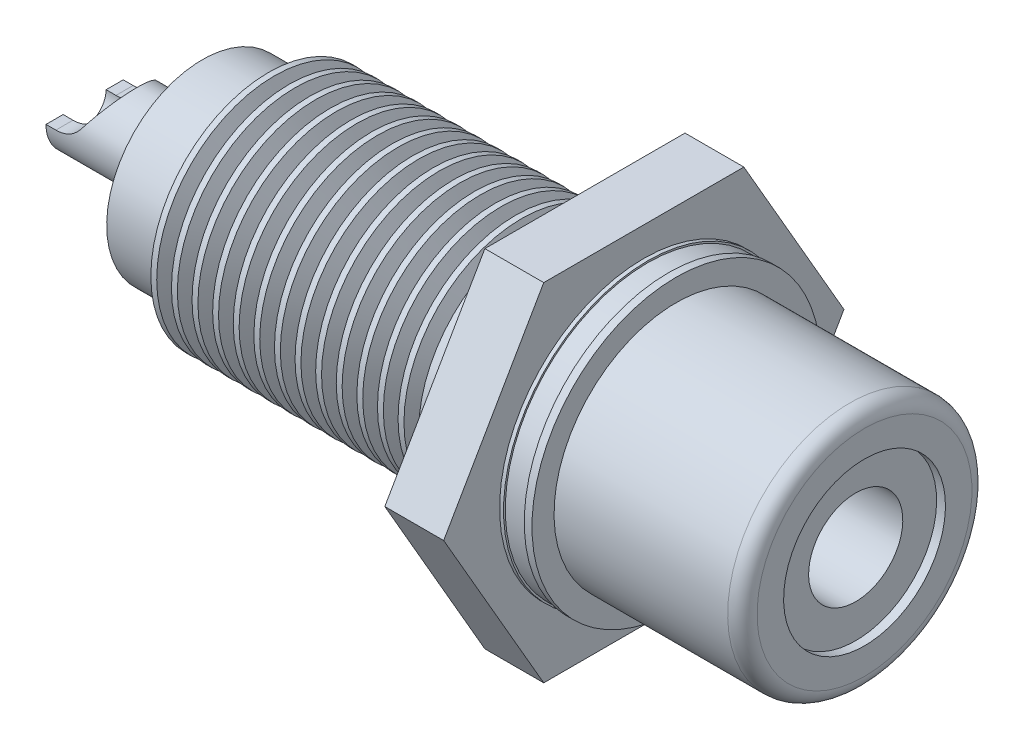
from build123d import *

# Parameters (mm, degrees)
CUT_EXTRUDE1_START = -10
CUT_EXTRUDE1_DEPTH = 10
SKETCH3_R          = 1.6
CUT_EXTRUDE2_DEPTH = 16
SKETCH4_R          = 2.75
CUT_EXTRUDE3_DEPTH = 0.3
CUT_EXTRUDE4_DEPTH = 5.5
SKETCH7_R          = 0.730212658
CUT_EXTRUDE5_DEPTH = 11


with BuildPart() as part:
    # Sketch1 → Revolve1 (revolve)
    with BuildSketch(Plane.XY, mode=Mode.PRIVATE) as revolve1_sk:
        with BuildLine():
            Line((0.661994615, 4.15), (-5.238005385, 4.15))
            Line((-5.238005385, 4.15), (-5.238005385, 4.9))
            Line((-5.238005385, 4.9), (-5.500168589, 4.9))
            Line((-5.500168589, 4.9), (-5.500168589, 4.841349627))
            Line((-5.500168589, 4.841349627), (-6.203848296, 4.841349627))
            Line((-6.203848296, 4.841349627), (-6.203848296, 4.9))
            Line((-6.203848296, 4.9), (-6.338005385, 4.9))
            Line((-6.338005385, 4.9), (-6.338005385, 6.8))
            Line((-6.338005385, 6.8), (-8.338005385, 6.8))
            Line((-8.338005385, 6.8), (-8.338005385, 4))
            Line((-8.338005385, 4), (-9.988005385, 4))
            Line((-9.988005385, 4), (-10.238005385, 3.5))
            Line((-10.238005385, 3.5), (-10.488005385, 4))
            Line((-10.488005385, 4), (-10.688005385, 4))
            Line((-10.688005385, 4), (-10.938005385, 3.5))
            Line((-10.938005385, 3.5), (-11.188005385, 4))
            Line((-11.188005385, 4), (-11.388005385, 4))
            Line((-11.388005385, 4), (-11.638005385, 3.5))
            Line((-11.638005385, 3.5), (-11.888005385, 4))
            Line((-11.888005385, 4), (-12.088005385, 4))
            Line((-12.088005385, 4), (-12.338005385, 3.5))
            Line((-12.338005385, 3.5), (-12.588005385, 4))
            Line((-12.588005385, 4), (-12.788005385, 4))
            Line((-12.788005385, 4), (-13.038005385, 3.5))
            Line((-13.038005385, 3.5), (-13.288005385, 4))
            Line((-13.288005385, 4), (-13.488005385, 4))
            Line((-13.488005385, 4), (-13.738005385, 3.5))
            Line((-13.738005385, 3.5), (-13.988005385, 4))
            Line((-13.988005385, 4), (-14.188005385, 4))
            Line((-14.188005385, 4), (-14.438005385, 3.5))
            Line((-14.438005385, 3.5), (-14.688005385, 4))
            Line((-14.688005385, 4), (-14.888005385, 4))
            Line((-14.888005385, 4), (-15.138005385, 3.5))
            Line((-15.138005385, 3.5), (-15.388005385, 4))
            Line((-15.388005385, 4), (-15.588005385, 4))
            Line((-15.588005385, 4), (-15.838005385, 3.5))
            Line((-15.838005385, 3.5), (-16.088005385, 4))
            Line((-16.088005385, 4), (-16.288005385, 4))
            Line((-16.288005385, 4), (-16.538005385, 3.5))
            Line((-16.538005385, 3.5), (-16.788005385, 4))
            Line((-16.788005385, 4), (-16.988005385, 4))
            Line((-16.988005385, 4), (-17.238005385, 3.5))
            Line((-17.238005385, 3.5), (-17.488005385, 4))
            Line((-17.488005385, 4), (-17.688005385, 4))
            Line((-17.688005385, 4), (-17.938005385, 3.5))
            Line((-17.938005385, 3.5), (-18.188005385, 4))
            Line((-18.188005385, 4), (-18.388005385, 4))
            Line((-18.388005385, 4), (-18.638005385, 3.5))
            Line((-18.638005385, 3.5), (-18.888005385, 4))
            Line((-18.888005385, 4), (-19.088005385, 4))
            Line((-19.088005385, 4), (-19.338005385, 3.5))
            Line((-19.338005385, 3.5), (-19.338005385, 3.25))
            Line((-19.338005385, 3.25), (-21.338005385, 3.25))
            Line((-21.338005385, 3.25), (-21.338005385, 1.311852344))
            Line((-21.338005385, 1.311852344), (-25.338005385, 1.311852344))
            Line((-25.338005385, 1.311852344), (-25.338005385, 0))
            Line((-25.338005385, 0), (-21.338005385, 0))
            Line((-21.338005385, 0), (1.161994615, 0))
            Line((1.161994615, 0), (1.161994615, 3.65))
            ThreePointArc((1.161994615, 3.65), (1.015548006, 4.003553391), (0.661994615, 4.15))
        make_face()
    revolve(revolve1_sk.sketch.rotate(Axis((-21.338005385, 0, 0), (1, 0, 0)), 180), axis=Axis((-21.338005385, 0, 0), (1, 0, 0)))

    # Sketch2 → Cut-Extrude1 (cut)
    with BuildSketch(Plane(origin=(-6.338005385, 0, 0), x_dir=(0, 0, -1), z_dir=(1, 0, 0)).offset(CUT_EXTRUDE1_START)):
        with BuildLine():
            Line((-6.8, 0), (-3.4, 5.888972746))
            ThreePointArc((-3.4, 5.888972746), (-5.888972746, 3.4), (-6.8, 0))
        make_face()
        with BuildLine():
            ThreePointArc((-6.8, 0), (-5.888972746, -3.4), (-3.4, -5.888972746))
            Line((-3.4, -5.888972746), (-6.8, 0))
        make_face()
        with BuildLine():
            ThreePointArc((-3.4, -5.888972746), (0, -6.8), (3.4, -5.888972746))
            Line((3.4, -5.888972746), (-3.4, -5.888972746))
        make_face()
        with BuildLine():
            ThreePointArc((3.4, -5.888972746), (5.888972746, -3.4), (6.8, 0))
            Line((6.8, 0), (3.4, -5.888972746))
        make_face()
        with BuildLine():
            Line((3.4, 5.888972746), (6.8, 0))
            ThreePointArc((6.8, 0), (5.888972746, 3.4), (3.4, 5.888972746))
        make_face()
        with BuildLine():
            Line((-3.4, 5.888972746), (3.4, 5.888972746))
            ThreePointArc((3.4, 5.888972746), (0, 6.8), (-3.4, 5.888972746))
        make_face()
    extrude(amount=CUT_EXTRUDE1_DEPTH, mode=Mode.SUBTRACT)

    # Sketch3 → Cut-Extrude2 (cut)
    with BuildSketch(Plane(origin=(1.161994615, 0, 0), x_dir=(0, 0, -1), z_dir=(1, 0, 0))):
        with Locations(Location((0, 0, 0), (0, 0, 90))):
            Circle(SKETCH3_R)
    extrude(amount=-CUT_EXTRUDE2_DEPTH, mode=Mode.SUBTRACT)

    # Sketch4 → Cut-Extrude3 (cut)
    with BuildSketch(Plane(origin=(1.161994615, 0, 0), x_dir=(0, 0, -1), z_dir=(1, 0, 0))):
        with Locations(Location((0, 0, 0), (0, 0, 90))):
            Circle(SKETCH4_R)
    extrude(amount=-CUT_EXTRUDE3_DEPTH, mode=Mode.SUBTRACT)

    # Sketch6 → Cut-Extrude4 (cut, symmetric)
    with BuildSketch(Plane.XY):
        with BuildLine():
            Line((-25.338005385, 1.311852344), (-25.338005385, 0))
            Line((-25.338005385, 0), (-25.002817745, 0))
            ThreePointArc((-25.002817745, 0), (-24.540261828, 0.11340989), (-24.182622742, 0.427915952))
            Line((-24.182622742, 0.427915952), (-23.566079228, 1.311852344))
            Line((-23.566079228, 1.311852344), (-25.338005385, 1.311852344))
        make_face()
    extrude(amount=CUT_EXTRUDE4_DEPTH, both=True, mode=Mode.SUBTRACT)

    # Sketch7 → Cut-Extrude5 (cut)
    with BuildSketch(Plane.ZY.offset(25.338005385)):
        Circle(SKETCH7_R)
    extrude(amount=-CUT_EXTRUDE5_DEPTH, mode=Mode.SUBTRACT)


solid = part.part
